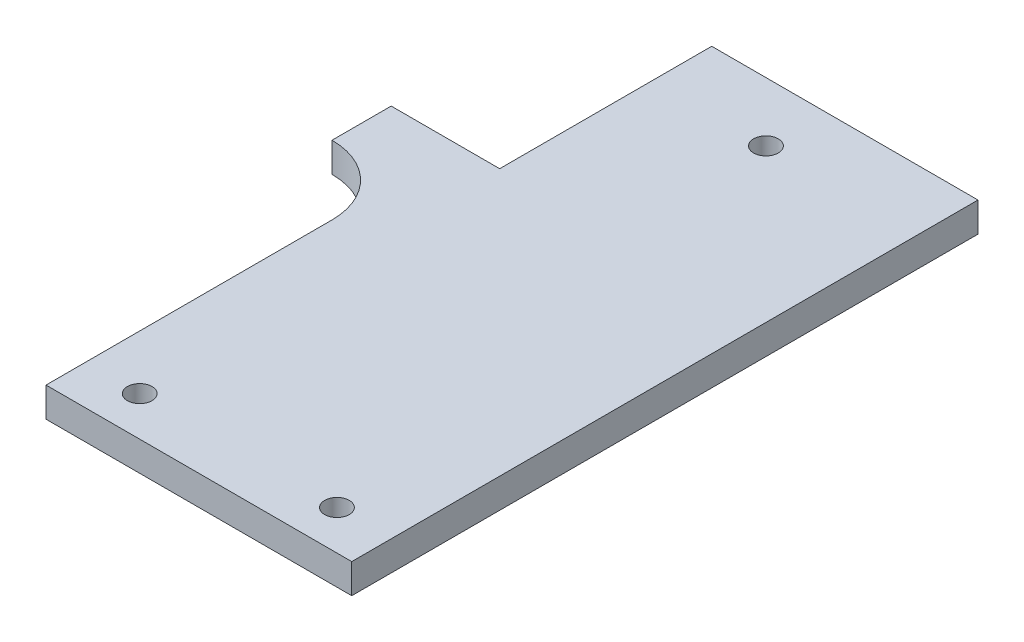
from build123d import *

# Parameters (mm, degrees)
EXTRUDE1_DEPTH    = 6
M6_TAPPED_HOLE1_D = 5


with BuildPart() as part:
    # Sketch1 → Extrude1 (new body)
    with BuildSketch(Plane(origin=(0, 0, 0), x_dir=(1, 0, 0), z_dir=(0, 1, 0))):
        with BuildLine():
            Line((8, 127), (8, 84))
            Line((8, 84), (-14, 84))
            Line((-14, 84), (-14, 72))
            ThreePointArc((-14, 72), (-4.100505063, 67.899494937), (0, 58))
            Line((0, 58), (0, 0))
            Line((0, 0), (62, 0))
            Line((62, 0), (62, 127))
            Line((62, 127), (8, 127))
        make_face()
    extrude(amount=EXTRUDE1_DEPTH)

    # M6 Tapped Hole1 (through all)
    with Locations(Plane(origin=(31, 6, -115), x_dir=(0, 0, 1), z_dir=(0, 1, 0))):
        with Locations((0, 0), (107, -20), (107, 20)):
            Hole(M6_TAPPED_HOLE1_D / 2)


solid = part.part
